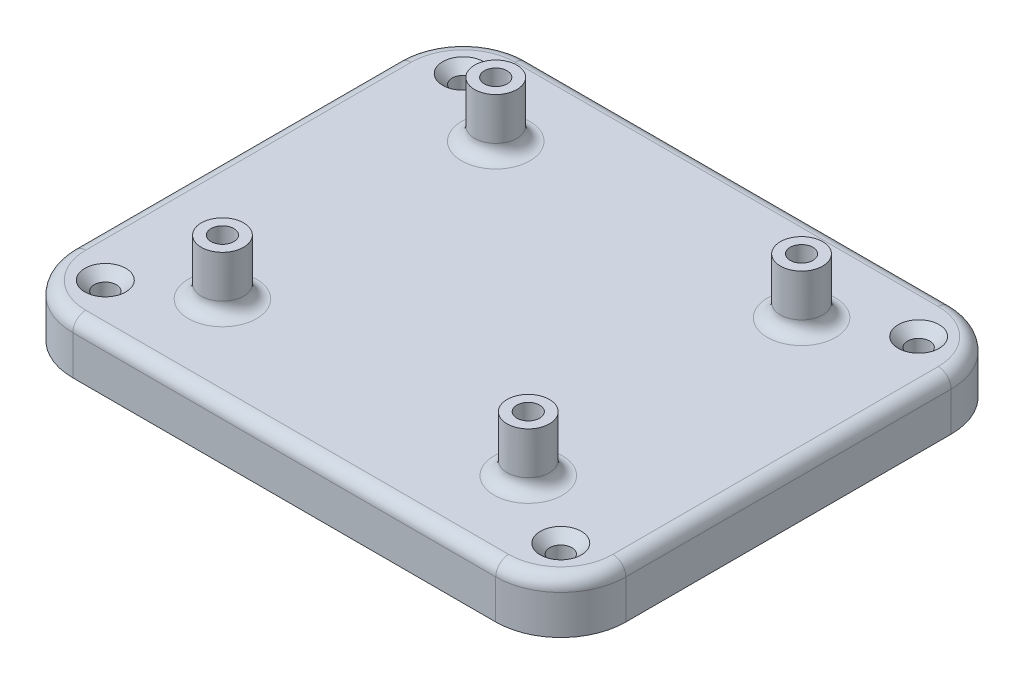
from build123d import *

# Parameters (mm, degrees)
SKETCH1_W                                           = 85
SKETCH1_H                                           = 70
BOSS_EXTRUDE1_DEPTH                                 = 4
SKETCH2_R                                           = 3.25
BOSS_EXTRUDE2_DEPTH                                 = 8.5
SKETCH4_R                                           = 1.75
CUT_EXTRUDE1_DEPTH                                  = 58.476081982
CSK_FOR_M3_COUNTERSUNK_FLAT_HEAD_SCREW1_D           = 3.4
CSK_FOR_M3_COUNTERSUNK_FLAT_HEAD_SCREW1_CSINK_D     = 6.3
CSK_FOR_M3_COUNTERSUNK_FLAT_HEAD_SCREW1_CSINK_ANGLE = 90
FILLET1_R                                           = 2
FILLET2_R                                           = 10
FILLET3_R                                           = 2
CUT_EXTRUDE2_DEPTH                                  = 4


with BuildPart() as part:
    # Sketch1 → Boss-Extrude1 (new, symmetric)
    with BuildSketch(Plane(origin=(0, 0, 0), x_dir=(1, 0, 0), z_dir=(0, 1, 0))):
        Rectangle(SKETCH1_W, SKETCH1_H)
    extrude(amount=BOSS_EXTRUDE1_DEPTH, both=True)

    # Sketch2 → Boss-Extrude2 (add)
    with BuildSketch(Plane(origin=(0, 4, 0), x_dir=(1, 0, 0), z_dir=(0, 1, 0))):
        with Locations(Location((-23.5, 21, 0), (0, 0, 90))):
            Circle(SKETCH2_R)
        with Locations(Location((23.5, 21, 0), (0, 0, 90))):
            Circle(SKETCH2_R)
        with Locations(Location((23.5, -21, 0), (0, 0, 90))):
            Circle(SKETCH2_R)
        with Locations(Location((-23.5, -21, 0), (0, 0, 90))):
            Circle(SKETCH2_R)
    extrude(amount=BOSS_EXTRUDE2_DEPTH)

    # Sketch4 → Cut-Extrude1 (cut, through all)
    with BuildSketch(Plane(origin=(0, 12.5, 0), x_dir=(1, 0, 0), z_dir=(0, 1, 0))):
        with Locations(Location((-23.5, -21, 0), (0, 0, 270))):
            Circle(SKETCH4_R)
        with Locations(Location((-23.5, 21, 0), (0, 0, 270))):
            Circle(SKETCH4_R)
        with Locations(Location((23.5, 21, 0), (0, 0, 270))):
            Circle(SKETCH4_R)
        with Locations(Location((23.5, -21, 0), (0, 0, 270))):
            Circle(SKETCH4_R)
    extrude(amount=-CUT_EXTRUDE1_DEPTH, mode=Mode.SUBTRACT)

    # CSK for M3 Countersunk Flat Head Screw1 (through all)
    with Locations(Plane(origin=(0, 4, 0), x_dir=(1, 0, 0), z_dir=(0, 1, 0))):
        with Locations((-35, 27.5), (35, 27.5), (35, -27.5), (-35, -27.5)):
            CounterSinkHole(CSK_FOR_M3_COUNTERSUNK_FLAT_HEAD_SCREW1_D / 2, CSK_FOR_M3_COUNTERSUNK_FLAT_HEAD_SCREW1_CSINK_D / 2, counter_sink_angle=CSK_FOR_M3_COUNTERSUNK_FLAT_HEAD_SCREW1_CSINK_ANGLE)

    # Fillet1
    fillet1_edges = [part.edges().sort_by_distance(p)[0] for p in [
        (-23.5, 4, -17.75),
        (23.5, 4, -17.75),
        (23.5, 4, 24.25),
        (-23.5, 4, 24.25),
    ]]
    fillet(fillet1_edges, radius=FILLET1_R)

    # Fillet2
    fillet2_edges = [part.edges().sort_by_distance(p)[0] for p in [
        (42.5, 0, 35),
        (-42.5, 0, 35),
        (-42.5, 0, -35),
        (42.5, 0, -35),
    ]]
    fillet(fillet2_edges, radius=FILLET2_R)

    # Fillet3
    fillet3_edges = [part.edges().sort_by_distance(p)[0] for p in [
        (-42.5, 4, 0),
        (0, 4, -35),
        (42.5, 4, 0),
        (0, 4, 35),
        (-39.571067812, 4, 32.071067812),
        (39.571067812, 4, 32.071067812),
        (39.571067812, 4, -32.071067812),
        (-39.571067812, 4, -32.071067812),
    ]]
    fillet(fillet3_edges, radius=FILLET3_R)

    # Sketch9 → Cut-Extrude2 (cut)
    with BuildSketch(Plane(origin=(0, -4, 0), x_dir=(-1, 0, 0), z_dir=(0, -1, 0))):
        Polygon((20.477849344, -20.025351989), (21.144854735, -23.129935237), (24.167005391, -24.104583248), (26.522150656, -21.974648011), (25.855145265, -18.870064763), (22.832994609, -17.895416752), align=None)
        Polygon((-26.675426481, -21), (-25.08771324, -23.75), (-21.91228676, -23.75), (-20.324573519, -21), (-21.91228676, -18.25), (-25.08771324, -18.25), align=None)
        Polygon((-25.858485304, 18.873763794), (-22.837868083, 17.894373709), (-20.479382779, 20.020609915), (-21.141514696, 23.126236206), (-24.162131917, 24.105626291), (-26.520617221, 21.979390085), align=None)
        Polygon((20.971453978, 19.079117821), (23.899259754, 17.84977382), (26.427805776, 19.770656), (26.028546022, 22.920882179), (23.100740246, 24.15022618), (20.572194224, 22.229344), align=None)
    extrude(amount=-CUT_EXTRUDE2_DEPTH, mode=Mode.SUBTRACT)


solid = part.part
